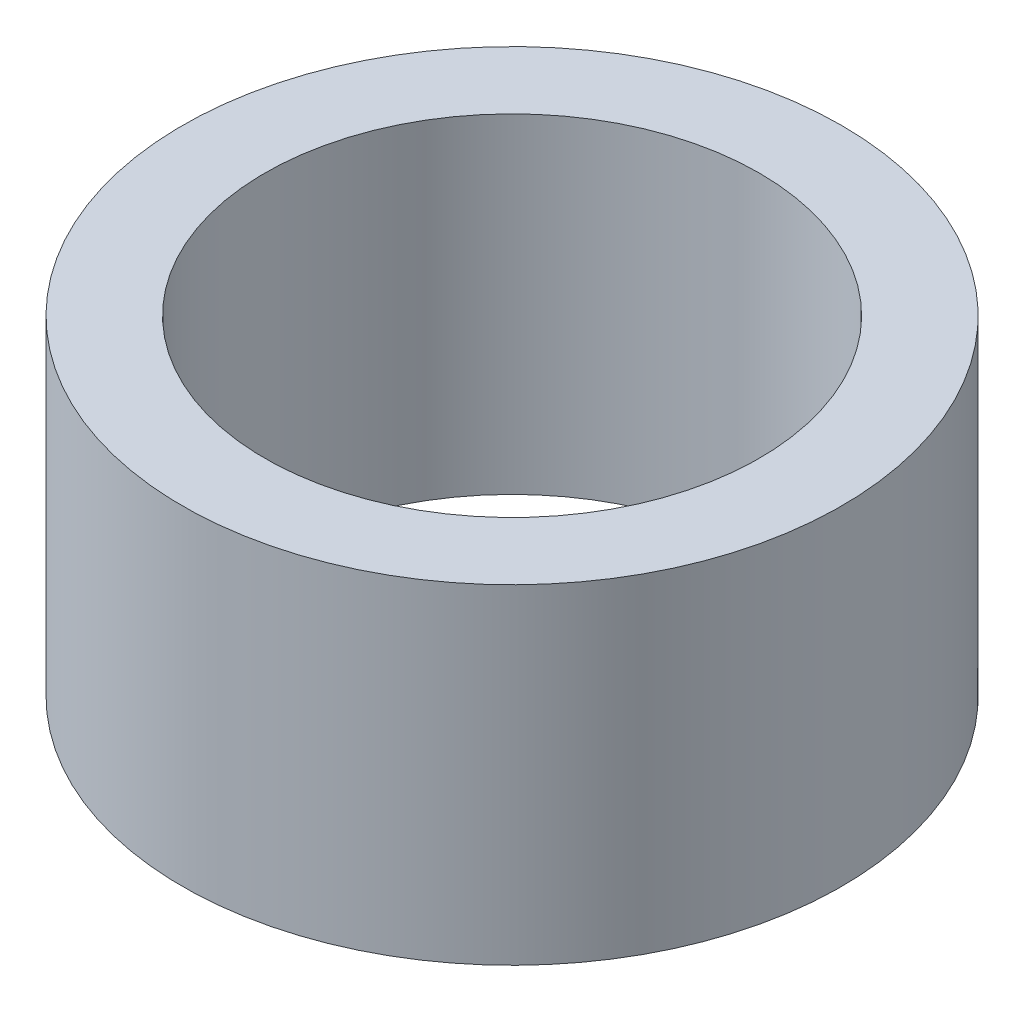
ISO-10303-21;
HEADER;
FILE_DESCRIPTION(('STEP AP214'),'2;1');
FILE_NAME('part.step','',(''),(''),'','','');
FILE_SCHEMA(('AUTOMOTIVE_DESIGN { 1 0 10303 214 1 1 1 1 }'));
ENDSEC;
DATA;
#1=APPLICATION_CONTEXT('core data for automotive mechanical design processes');
#2=APPLICATION_PROTOCOL_DEFINITION('international standard','automotive_design',2000,#1);
#3=PRODUCT_CONTEXT('',#1,'mechanical');
#4=PRODUCT('Part','Part','',(#3));
#5=PRODUCT_RELATED_PRODUCT_CATEGORY('part','',(#4));
#6=PRODUCT_DEFINITION_FORMATION('','',#4);
#7=PRODUCT_DEFINITION_CONTEXT('part definition',#1,'design');
#8=PRODUCT_DEFINITION('design','',#6,#7);
#9=PRODUCT_DEFINITION_SHAPE('','',#8);
#10=(LENGTH_UNIT() NAMED_UNIT(*) SI_UNIT(.MILLI.,.METRE.));
#11=(NAMED_UNIT(*) PLANE_ANGLE_UNIT() SI_UNIT($,.RADIAN.));
#12=(NAMED_UNIT(*) SI_UNIT($,.STERADIAN.) SOLID_ANGLE_UNIT());
#13=UNCERTAINTY_MEASURE_WITH_UNIT(LENGTH_MEASURE(1.E-05),#10,'distance_accuracy_value','');
#14=(GEOMETRIC_REPRESENTATION_CONTEXT(3) GLOBAL_UNCERTAINTY_ASSIGNED_CONTEXT((#13)) GLOBAL_UNIT_ASSIGNED_CONTEXT((#10,
#11,#12)) REPRESENTATION_CONTEXT('',''));
#15=CARTESIAN_POINT('',(0.,0.,0.));
#16=DIRECTION('',(0.,0.,1.));
#17=DIRECTION('',(1.,0.,0.));
#18=AXIS2_PLACEMENT_3D('',#15,#16,#17);
#19=CARTESIAN_POINT('',(0.,4.2,0.));
#20=DIRECTION('',(0.,-1.,0.));
#21=DIRECTION('',(0.,0.,-1.));
#22=AXIS2_PLACEMENT_3D('',#19,#20,#21);
#23=CYLINDRICAL_SURFACE('',#22,3.);
#24=CARTESIAN_POINT('',(0.,0.,0.));
#25=DIRECTION('',(0.,-1.,0.));
#26=DIRECTION('',(0.,0.,-1.));
#27=AXIS2_PLACEMENT_3D('',#24,#25,#26);
#28=CIRCLE('',#27,3.);
#29=CARTESIAN_POINT('',(0.,0.,-3.));
#30=VERTEX_POINT('',#29);
#31=EDGE_CURVE('E26',#30,#30,#28,.F.);
#32=ORIENTED_EDGE('',*,*,#31,.F.);
#33=EDGE_LOOP('',(#32));
#34=FACE_BOUND('',#33,.T.);
#35=CARTESIAN_POINT('',(0.,4.,0.));
#36=DIRECTION('',(0.,-1.,0.));
#37=DIRECTION('',(0.,0.,-1.));
#38=AXIS2_PLACEMENT_3D('',#35,#36,#37);
#39=CIRCLE('',#38,3.);
#40=CARTESIAN_POINT('',(0.,4.,-3.));
#41=VERTEX_POINT('',#40);
#42=EDGE_CURVE('E17',#41,#41,#39,.F.);
#43=ORIENTED_EDGE('',*,*,#42,.T.);
#44=EDGE_LOOP('',(#43));
#45=FACE_BOUND('',#44,.T.);
#46=ADVANCED_FACE('F14',(#34,#45),#23,.F.);
#47=CARTESIAN_POINT('',(0.,4.,0.));
#48=DIRECTION('',(0.,-1.,0.));
#49=DIRECTION('',(0.,0.,-1.));
#50=AXIS2_PLACEMENT_3D('',#47,#48,#49);
#51=PLANE('',#50);
#52=ORIENTED_EDGE('',*,*,#42,.F.);
#53=EDGE_LOOP('',(#52));
#54=FACE_BOUND('',#53,.T.);
#55=CARTESIAN_POINT('',(0.,4.,0.));
#56=DIRECTION('',(0.,-1.,0.));
#57=DIRECTION('',(0.,0.,-1.));
#58=AXIS2_PLACEMENT_3D('',#55,#56,#57);
#59=CIRCLE('',#58,4.);
#60=CARTESIAN_POINT('',(0.,4.,-4.));
#61=VERTEX_POINT('',#60);
#62=EDGE_CURVE('E21',#61,#61,#59,.T.);
#63=ORIENTED_EDGE('',*,*,#62,.F.);
#64=EDGE_LOOP('',(#63));
#65=FACE_BOUND('',#64,.T.);
#66=ADVANCED_FACE('F35',(#54,#65),#51,.F.);
#67=CARTESIAN_POINT('',(0.,0.,0.));
#68=DIRECTION('',(0.,-1.,0.));
#69=DIRECTION('',(0.,0.,-1.));
#70=AXIS2_PLACEMENT_3D('',#67,#68,#69);
#71=PLANE('',#70);
#72=ORIENTED_EDGE('',*,*,#31,.T.);
#73=EDGE_LOOP('',(#72));
#74=FACE_BOUND('',#73,.T.);
#75=CARTESIAN_POINT('',(0.,0.,0.));
#76=DIRECTION('',(0.,-1.,0.));
#77=DIRECTION('',(0.,0.,-1.));
#78=AXIS2_PLACEMENT_3D('',#75,#76,#77);
#79=CIRCLE('',#78,4.);
#80=CARTESIAN_POINT('',(0.,0.,-4.));
#81=VERTEX_POINT('',#80);
#82=EDGE_CURVE('E10',#81,#81,#79,.F.);
#83=ORIENTED_EDGE('',*,*,#82,.F.);
#84=EDGE_LOOP('',(#83));
#85=FACE_BOUND('',#84,.T.);
#86=ADVANCED_FACE('F38',(#74,#85),#71,.T.);
#87=CARTESIAN_POINT('',(0.,4.2,0.));
#88=DIRECTION('',(0.,-1.,0.));
#89=DIRECTION('',(0.,0.,-1.));
#90=AXIS2_PLACEMENT_3D('',#87,#88,#89);
#91=CYLINDRICAL_SURFACE('',#90,4.);
#92=ORIENTED_EDGE('',*,*,#82,.T.);
#93=EDGE_LOOP('',(#92));
#94=FACE_BOUND('',#93,.T.);
#95=ORIENTED_EDGE('',*,*,#62,.T.);
#96=EDGE_LOOP('',(#95));
#97=FACE_BOUND('',#96,.T.);
#98=ADVANCED_FACE('F41',(#94,#97),#91,.T.);
#99=CLOSED_SHELL('',(#46,#66,#86,#98));
#100=MANIFOLD_SOLID_BREP('B1',#99);
#101=ADVANCED_BREP_SHAPE_REPRESENTATION('',(#18,#100),#14);
#102=SHAPE_DEFINITION_REPRESENTATION(#9,#101);
ENDSEC;
END-ISO-10303-21;
